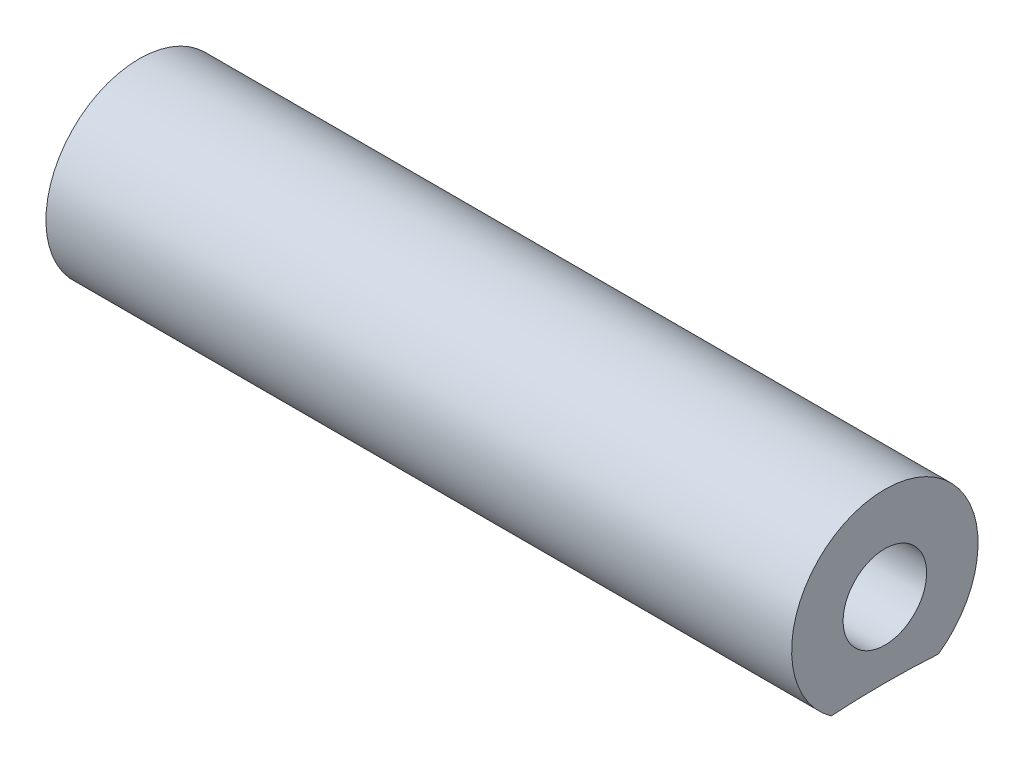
from build123d import *

# Parameters (mm, degrees)
SKETCH1_R             = 3.175
EXTRUDE1_DEPTH        = 25.4
SKETCH2_R             = 29.083
CUT_EXTRUDE1_DEPTH    = 26.793821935
F_4_40_TAPPED_HOLE1_D = 2.8448


with BuildPart() as part:
    # Sketch1 → Extrude1 (new body)
    with BuildSketch(Plane(origin=(0, 0, 0), x_dir=(0, 0, -1), z_dir=(1, 0, 0))):
        Circle(SKETCH1_R)
    extrude(amount=EXTRUDE1_DEPTH)

    # Sketch2 → Cut-Extrude1 (cut, through all)
    with BuildSketch(Plane.ZY):
        with Locations((0, -31.623)):
            Circle(SKETCH2_R)
    extrude(amount=-CUT_EXTRUDE1_DEPTH, mode=Mode.SUBTRACT)

    # 4-40 Tapped Hole1 (through all)
    with Locations(Plane(origin=(0, 0, 0), x_dir=(0, 0, -1), z_dir=(-1, 0, 0))):
        with Locations((0, 0)):
            Hole(F_4_40_TAPPED_HOLE1_D / 2)


solid = part.part
